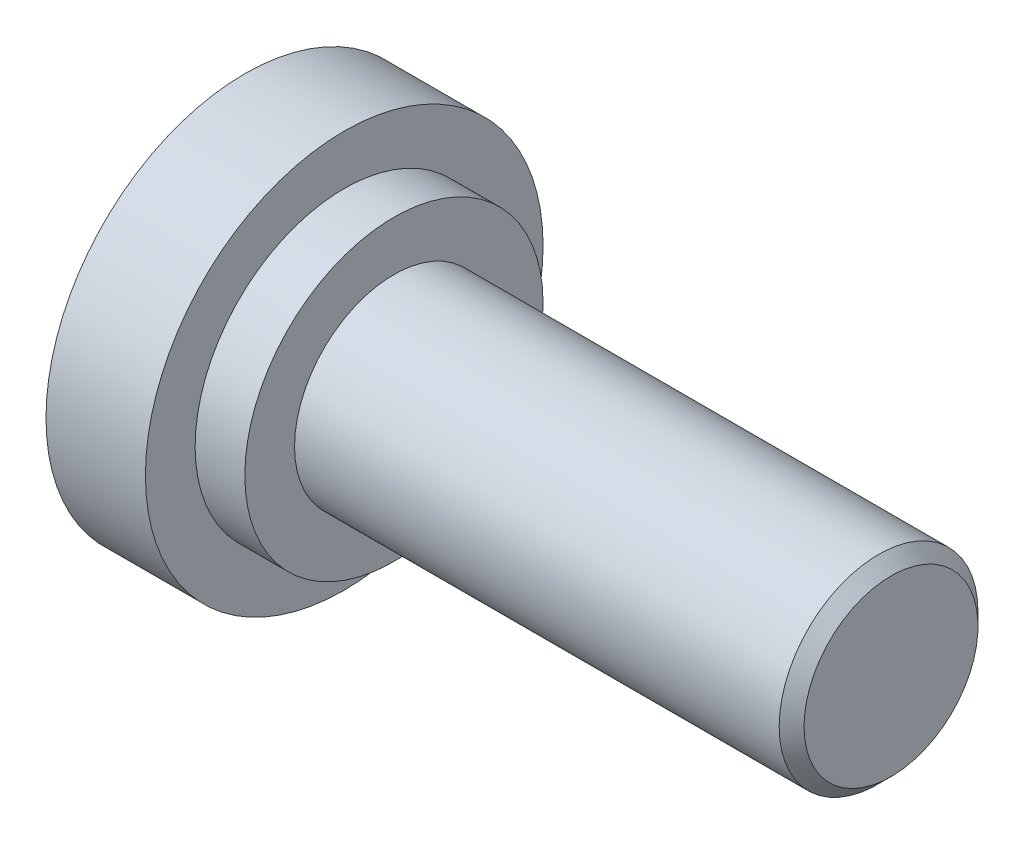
ISO-10303-21;
HEADER;
FILE_DESCRIPTION(('STEP AP214'),'2;1');
FILE_NAME('part.step','',(''),(''),'','','');
FILE_SCHEMA(('AUTOMOTIVE_DESIGN { 1 0 10303 214 1 1 1 1 }'));
ENDSEC;
DATA;
#1=APPLICATION_CONTEXT('core data for automotive mechanical design processes');
#2=APPLICATION_PROTOCOL_DEFINITION('international standard','automotive_design',2000,#1);
#3=PRODUCT_CONTEXT('',#1,'mechanical');
#4=PRODUCT('Part','Part','',(#3));
#5=PRODUCT_RELATED_PRODUCT_CATEGORY('part','',(#4));
#6=PRODUCT_DEFINITION_FORMATION('','',#4);
#7=PRODUCT_DEFINITION_CONTEXT('part definition',#1,'design');
#8=PRODUCT_DEFINITION('design','',#6,#7);
#9=PRODUCT_DEFINITION_SHAPE('','',#8);
#10=(LENGTH_UNIT() NAMED_UNIT(*) SI_UNIT(.MILLI.,.METRE.));
#11=(NAMED_UNIT(*) PLANE_ANGLE_UNIT() SI_UNIT($,.RADIAN.));
#12=(NAMED_UNIT(*) SI_UNIT($,.STERADIAN.) SOLID_ANGLE_UNIT());
#13=UNCERTAINTY_MEASURE_WITH_UNIT(LENGTH_MEASURE(1.E-05),#10,'distance_accuracy_value','');
#14=(GEOMETRIC_REPRESENTATION_CONTEXT(3) GLOBAL_UNCERTAINTY_ASSIGNED_CONTEXT((#13)) GLOBAL_UNIT_ASSIGNED_CONTEXT((#10,
#11,#12)) REPRESENTATION_CONTEXT('',''));
#15=CARTESIAN_POINT('',(0.,0.,0.));
#16=DIRECTION('',(0.,0.,1.));
#17=DIRECTION('',(1.,0.,0.));
#18=AXIS2_PLACEMENT_3D('',#15,#16,#17);
#19=CARTESIAN_POINT('',(0.,0.,0.));
#20=DIRECTION('',(1.,0.,0.));
#21=DIRECTION('',(0.,0.,-1.));
#22=AXIS2_PLACEMENT_3D('',#19,#20,#21);
#23=PLANE('',#22);
#24=CARTESIAN_POINT('',(0.,0.,0.));
#25=DIRECTION('',(-1.,0.,0.));
#26=DIRECTION('',(0.,0.,1.));
#27=AXIS2_PLACEMENT_3D('',#24,#25,#26);
#28=CIRCLE('',#27,8.);
#29=CARTESIAN_POINT('',(0.,0.,8.));
#30=VERTEX_POINT('',#29);
#31=EDGE_CURVE('E40',#30,#30,#28,.T.);
#32=ORIENTED_EDGE('',*,*,#31,.T.);
#33=EDGE_LOOP('',(#32));
#34=FACE_BOUND('',#33,.T.);
#35=ADVANCED_FACE('F30',(#34),#23,.F.);
#36=CARTESIAN_POINT('',(-4.18019429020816,0.,0.));
#37=DIRECTION('',(-1.,0.,0.));
#38=DIRECTION('',(0.,0.,1.));
#39=AXIS2_PLACEMENT_3D('',#36,#37,#38);
#40=CYLINDRICAL_SURFACE('',#39,8.);
#41=ORIENTED_EDGE('',*,*,#31,.F.);
#42=EDGE_LOOP('',(#41));
#43=FACE_BOUND('',#42,.T.);
#44=CARTESIAN_POINT('',(4.,0.,0.));
#45=DIRECTION('',(-1.,0.,0.));
#46=DIRECTION('',(0.,0.,1.));
#47=AXIS2_PLACEMENT_3D('',#44,#45,#46);
#48=CIRCLE('',#47,8.);
#49=CARTESIAN_POINT('',(4.,0.,8.));
#50=VERTEX_POINT('',#49);
#51=EDGE_CURVE('E44',#50,#50,#48,.T.);
#52=ORIENTED_EDGE('',*,*,#51,.T.);
#53=EDGE_LOOP('',(#52));
#54=FACE_BOUND('',#53,.T.);
#55=ADVANCED_FACE('F75',(#43,#54),#40,.T.);
#56=CARTESIAN_POINT('',(4.,8.,0.));
#57=DIRECTION('',(-1.,0.,0.));
#58=DIRECTION('',(0.,0.,1.));
#59=AXIS2_PLACEMENT_3D('',#56,#57,#58);
#60=PLANE('',#59);
#61=ORIENTED_EDGE('',*,*,#51,.F.);
#62=EDGE_LOOP('',(#61));
#63=FACE_BOUND('',#62,.T.);
#64=CARTESIAN_POINT('',(4.,0.,0.));
#65=DIRECTION('',(-1.,0.,0.));
#66=DIRECTION('',(0.,0.,1.));
#67=AXIS2_PLACEMENT_3D('',#64,#65,#66);
#68=CIRCLE('',#67,6.);
#69=CARTESIAN_POINT('',(4.,0.,6.));
#70=VERTEX_POINT('',#69);
#71=EDGE_CURVE('E49',#70,#70,#68,.T.);
#72=ORIENTED_EDGE('',*,*,#71,.T.);
#73=EDGE_LOOP('',(#72));
#74=FACE_BOUND('',#73,.T.);
#75=ADVANCED_FACE('F80',(#63,#74),#60,.F.);
#76=CARTESIAN_POINT('',(-4.18019429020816,0.,0.));
#77=DIRECTION('',(-1.,0.,0.));
#78=DIRECTION('',(0.,0.,1.));
#79=AXIS2_PLACEMENT_3D('',#76,#77,#78);
#80=CYLINDRICAL_SURFACE('',#79,6.);
#81=ORIENTED_EDGE('',*,*,#71,.F.);
#82=EDGE_LOOP('',(#81));
#83=FACE_BOUND('',#82,.T.);
#84=CARTESIAN_POINT('',(6.,0.,0.));
#85=DIRECTION('',(-1.,0.,0.));
#86=DIRECTION('',(0.,0.,1.));
#87=AXIS2_PLACEMENT_3D('',#84,#85,#86);
#88=CIRCLE('',#87,6.);
#89=CARTESIAN_POINT('',(6.,0.,6.));
#90=VERTEX_POINT('',#89);
#91=EDGE_CURVE('E52',#90,#90,#88,.T.);
#92=ORIENTED_EDGE('',*,*,#91,.T.);
#93=EDGE_LOOP('',(#92));
#94=FACE_BOUND('',#93,.T.);
#95=ADVANCED_FACE('F71',(#83,#94),#80,.T.);
#96=CARTESIAN_POINT('',(6.,6.,0.));
#97=DIRECTION('',(-1.,0.,0.));
#98=DIRECTION('',(0.,0.,1.));
#99=AXIS2_PLACEMENT_3D('',#96,#97,#98);
#100=PLANE('',#99);
#101=ORIENTED_EDGE('',*,*,#91,.F.);
#102=EDGE_LOOP('',(#101));
#103=FACE_BOUND('',#102,.T.);
#104=CARTESIAN_POINT('',(6.,0.,0.));
#105=DIRECTION('',(-1.,0.,0.));
#106=DIRECTION('',(0.,0.,1.));
#107=AXIS2_PLACEMENT_3D('',#104,#105,#106);
#108=CIRCLE('',#107,4.);
#109=CARTESIAN_POINT('',(6.,0.,4.));
#110=VERTEX_POINT('',#109);
#111=EDGE_CURVE('E55',#110,#110,#108,.T.);
#112=ORIENTED_EDGE('',*,*,#111,.T.);
#113=EDGE_LOOP('',(#112));
#114=FACE_BOUND('',#113,.T.);
#115=ADVANCED_FACE('F59',(#103,#114),#100,.F.);
#116=CARTESIAN_POINT('',(-4.18019429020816,0.,0.));
#117=DIRECTION('',(-1.,0.,0.));
#118=DIRECTION('',(0.,0.,1.));
#119=AXIS2_PLACEMENT_3D('',#116,#117,#118);
#120=CYLINDRICAL_SURFACE('',#119,4.);
#121=CARTESIAN_POINT('',(25.5,0.,0.));
#122=DIRECTION('',(-1.,0.,0.));
#123=DIRECTION('',(0.,0.,1.));
#124=AXIS2_PLACEMENT_3D('',#121,#122,#123);
#125=CIRCLE('',#124,4.);
#126=CARTESIAN_POINT('',(25.5,0.,4.));
#127=VERTEX_POINT('',#126);
#128=EDGE_CURVE('E36',#127,#127,#125,.T.);
#129=ORIENTED_EDGE('',*,*,#128,.T.);
#130=EDGE_LOOP('',(#129));
#131=FACE_BOUND('',#130,.T.);
#132=ORIENTED_EDGE('',*,*,#111,.F.);
#133=EDGE_LOOP('',(#132));
#134=FACE_BOUND('',#133,.T.);
#135=ADVANCED_FACE('F61',(#131,#134),#120,.T.);
#136=CARTESIAN_POINT('',(26.,4.,0.));
#137=DIRECTION('',(-1.,0.,0.));
#138=DIRECTION('',(0.,0.,1.));
#139=AXIS2_PLACEMENT_3D('',#136,#137,#138);
#140=PLANE('',#139);
#141=CARTESIAN_POINT('',(26.,0.,0.));
#142=DIRECTION('',(-1.,0.,0.));
#143=DIRECTION('',(0.,0.,1.));
#144=AXIS2_PLACEMENT_3D('',#141,#142,#143);
#145=CIRCLE('',#144,3.5);
#146=CARTESIAN_POINT('',(26.,0.,3.5));
#147=VERTEX_POINT('',#146);
#148=EDGE_CURVE('E10',#147,#147,#145,.F.);
#149=ORIENTED_EDGE('',*,*,#148,.T.);
#150=EDGE_LOOP('',(#149));
#151=FACE_BOUND('',#150,.T.);
#152=ADVANCED_FACE('F63',(#151),#140,.F.);
#153=CARTESIAN_POINT('',(25.5,0.,0.));
#154=DIRECTION('',(-1.,0.,0.));
#155=DIRECTION('',(0.,0.,1.));
#156=AXIS2_PLACEMENT_3D('',#153,#154,#155);
#157=CONICAL_SURFACE('',#156,4.,0.785398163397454);
#158=ORIENTED_EDGE('',*,*,#148,.F.);
#159=EDGE_LOOP('',(#158));
#160=FACE_BOUND('',#159,.T.);
#161=ORIENTED_EDGE('',*,*,#128,.F.);
#162=EDGE_LOOP('',(#161));
#163=FACE_BOUND('',#162,.T.);
#164=ADVANCED_FACE('F69',(#160,#163),#157,.T.);
#165=CLOSED_SHELL('',(#35,#55,#75,#95,#115,#135,#152,#164));
#166=MANIFOLD_SOLID_BREP('B2',#165);
#167=ADVANCED_BREP_SHAPE_REPRESENTATION('',(#18,#166),#14);
#168=SHAPE_DEFINITION_REPRESENTATION(#9,#167);
ENDSEC;
END-ISO-10303-21;
